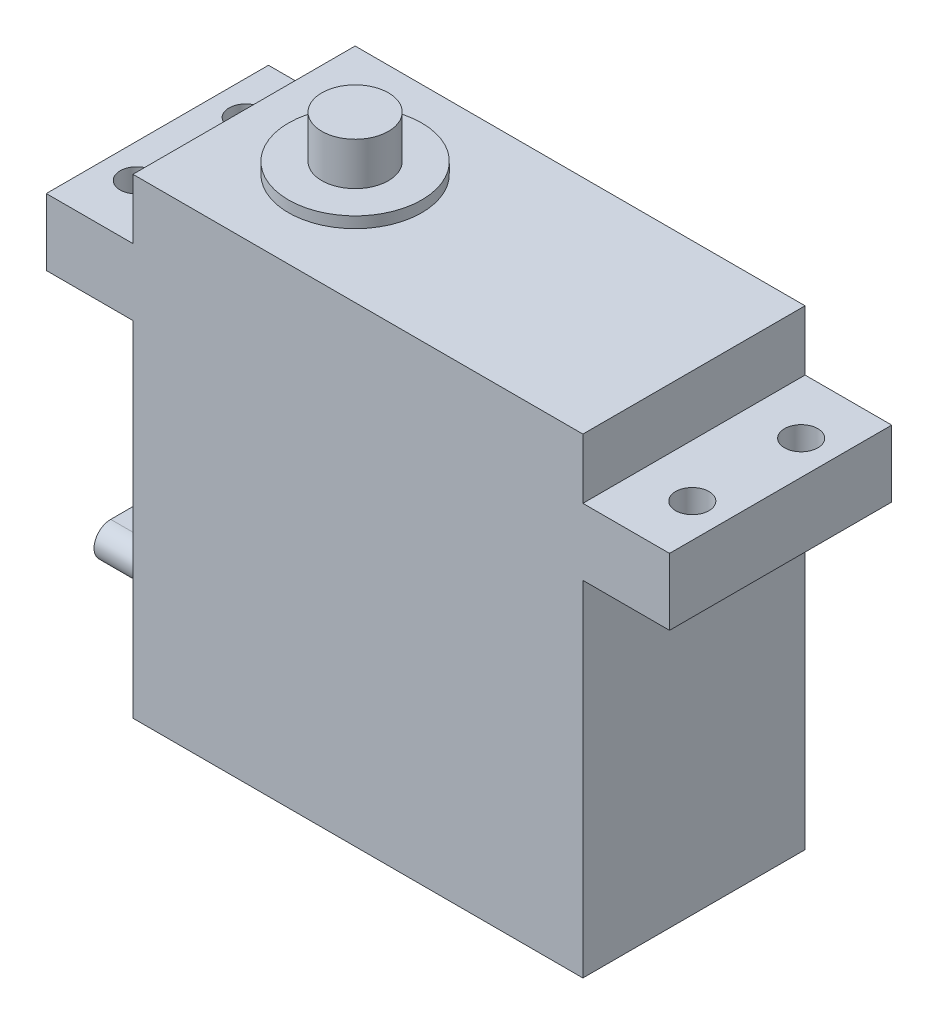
ISO-10303-21;
HEADER;
FILE_DESCRIPTION(('STEP AP214'),'2;1');
FILE_NAME('part.step','',(''),(''),'','','');
FILE_SCHEMA(('AUTOMOTIVE_DESIGN { 1 0 10303 214 1 1 1 1 }'));
ENDSEC;
DATA;
#1=APPLICATION_CONTEXT('core data for automotive mechanical design processes');
#2=APPLICATION_PROTOCOL_DEFINITION('international standard','automotive_design',2000,#1);
#3=PRODUCT_CONTEXT('',#1,'mechanical');
#4=PRODUCT('Part','Part','',(#3));
#5=PRODUCT_RELATED_PRODUCT_CATEGORY('part','',(#4));
#6=PRODUCT_DEFINITION_FORMATION('','',#4);
#7=PRODUCT_DEFINITION_CONTEXT('part definition',#1,'design');
#8=PRODUCT_DEFINITION('design','',#6,#7);
#9=PRODUCT_DEFINITION_SHAPE('','',#8);
#10=(LENGTH_UNIT() NAMED_UNIT(*) SI_UNIT(.MILLI.,.METRE.));
#11=(NAMED_UNIT(*) PLANE_ANGLE_UNIT() SI_UNIT($,.RADIAN.));
#12=(NAMED_UNIT(*) SI_UNIT($,.STERADIAN.) SOLID_ANGLE_UNIT());
#13=UNCERTAINTY_MEASURE_WITH_UNIT(LENGTH_MEASURE(1.E-05),#10,'distance_accuracy_value','');
#14=(GEOMETRIC_REPRESENTATION_CONTEXT(3) GLOBAL_UNCERTAINTY_ASSIGNED_CONTEXT((#13)) GLOBAL_UNIT_ASSIGNED_CONTEXT((#10,
#11,#12)) REPRESENTATION_CONTEXT('',''));
#15=CARTESIAN_POINT('',(0.,0.,0.));
#16=DIRECTION('',(0.,0.,1.));
#17=DIRECTION('',(1.,0.,0.));
#18=AXIS2_PLACEMENT_3D('',#15,#16,#17);
#19=CARTESIAN_POINT('',(10.,47.25,10.));
#20=DIRECTION('',(0.,-1.,0.));
#21=DIRECTION('',(0.,0.,-1.));
#22=AXIS2_PLACEMENT_3D('',#19,#20,#21);
#23=CYLINDRICAL_SURFACE('',#22,3.);
#24=CARTESIAN_POINT('',(10.,47.25,10.));
#25=DIRECTION('',(0.,1.,0.));
#26=DIRECTION('',(0.,0.,1.));
#27=AXIS2_PLACEMENT_3D('',#24,#25,#26);
#28=CIRCLE('',#27,3.);
#29=CARTESIAN_POINT('',(10.,47.25,7.));
#30=VERTEX_POINT('',#29);
#31=EDGE_CURVE('E11',#30,#30,#28,.T.);
#32=CARTESIAN_POINT('',(10.,43.4,10.));
#33=DIRECTION('',(0.,1.,0.));
#34=DIRECTION('',(0.,0.,1.));
#35=AXIS2_PLACEMENT_3D('',#32,#33,#34);
#36=CIRCLE('',#35,3.);
#37=CARTESIAN_POINT('',(10.,43.4,7.));
#38=VERTEX_POINT('',#37);
#39=EDGE_CURVE('E47',#38,#38,#36,.T.);
#40=CARTESIAN_POINT('',(10.,47.25,7.));
#41=CARTESIAN_POINT('',(10.,47.2098958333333,7.));
#42=CARTESIAN_POINT('',(10.,47.1697916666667,7.));
#43=CARTESIAN_POINT('',(10.,47.0895833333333,7.));
#44=CARTESIAN_POINT('',(10.,47.0494791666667,7.));
#45=CARTESIAN_POINT('',(10.,46.9692708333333,7.));
#46=CARTESIAN_POINT('',(10.,46.9291666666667,7.));
#47=CARTESIAN_POINT('',(10.,46.8489583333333,7.));
#48=CARTESIAN_POINT('',(10.,46.8088541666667,7.));
#49=CARTESIAN_POINT('',(10.,46.7286458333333,7.));
#50=CARTESIAN_POINT('',(10.,46.6885416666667,7.));
#51=CARTESIAN_POINT('',(10.,46.6083333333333,7.));
#52=CARTESIAN_POINT('',(10.,46.5682291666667,7.));
#53=CARTESIAN_POINT('',(10.,46.4880208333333,7.));
#54=CARTESIAN_POINT('',(10.,46.4479166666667,7.));
#55=CARTESIAN_POINT('',(10.,46.3677083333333,7.));
#56=CARTESIAN_POINT('',(10.,46.3276041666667,7.));
#57=CARTESIAN_POINT('',(10.,46.2473958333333,7.));
#58=CARTESIAN_POINT('',(10.,46.2072916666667,7.));
#59=CARTESIAN_POINT('',(10.,46.1270833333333,7.));
#60=CARTESIAN_POINT('',(10.,46.0869791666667,7.));
#61=CARTESIAN_POINT('',(10.,46.0067708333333,7.));
#62=CARTESIAN_POINT('',(10.,45.9666666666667,7.));
#63=CARTESIAN_POINT('',(10.,45.8864583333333,7.));
#64=CARTESIAN_POINT('',(10.,45.8463541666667,7.));
#65=CARTESIAN_POINT('',(10.,45.7661458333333,7.));
#66=CARTESIAN_POINT('',(10.,45.7260416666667,7.));
#67=CARTESIAN_POINT('',(10.,45.6458333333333,7.));
#68=CARTESIAN_POINT('',(10.,45.6057291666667,7.));
#69=CARTESIAN_POINT('',(10.,45.5255208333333,7.));
#70=CARTESIAN_POINT('',(10.,45.4854166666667,7.));
#71=CARTESIAN_POINT('',(10.,45.4052083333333,7.));
#72=CARTESIAN_POINT('',(10.,45.3651041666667,7.));
#73=CARTESIAN_POINT('',(10.,45.2848958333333,7.));
#74=CARTESIAN_POINT('',(10.,45.2447916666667,7.));
#75=CARTESIAN_POINT('',(10.,45.1645833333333,7.));
#76=CARTESIAN_POINT('',(10.,45.1244791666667,7.));
#77=CARTESIAN_POINT('',(10.,45.0442708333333,7.));
#78=CARTESIAN_POINT('',(10.,45.0041666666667,7.));
#79=CARTESIAN_POINT('',(10.,44.9239583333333,7.));
#80=CARTESIAN_POINT('',(10.,44.8838541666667,7.));
#81=CARTESIAN_POINT('',(10.,44.8036458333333,7.));
#82=CARTESIAN_POINT('',(10.,44.7635416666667,7.));
#83=CARTESIAN_POINT('',(10.,44.6833333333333,7.));
#84=CARTESIAN_POINT('',(10.,44.6432291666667,7.));
#85=CARTESIAN_POINT('',(10.,44.5630208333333,7.));
#86=CARTESIAN_POINT('',(10.,44.5229166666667,7.));
#87=CARTESIAN_POINT('',(10.,44.4427083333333,7.));
#88=CARTESIAN_POINT('',(10.,44.4026041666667,7.));
#89=CARTESIAN_POINT('',(10.,44.3223958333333,7.));
#90=CARTESIAN_POINT('',(10.,44.2822916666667,7.));
#91=CARTESIAN_POINT('',(10.,44.2020833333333,7.));
#92=CARTESIAN_POINT('',(10.,44.1619791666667,7.));
#93=CARTESIAN_POINT('',(10.,44.0817708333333,7.));
#94=CARTESIAN_POINT('',(10.,44.0416666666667,7.));
#95=CARTESIAN_POINT('',(10.,43.9614583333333,7.));
#96=CARTESIAN_POINT('',(10.,43.9213541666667,7.));
#97=CARTESIAN_POINT('',(10.,43.8411458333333,7.));
#98=CARTESIAN_POINT('',(10.,43.8010416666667,7.));
#99=CARTESIAN_POINT('',(10.,43.7208333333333,7.));
#100=CARTESIAN_POINT('',(10.,43.6807291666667,7.));
#101=CARTESIAN_POINT('',(10.,43.6005208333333,7.));
#102=CARTESIAN_POINT('',(10.,43.5604166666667,7.));
#103=CARTESIAN_POINT('',(10.,43.4802083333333,7.));
#104=CARTESIAN_POINT('',(10.,43.4401041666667,7.));
#105=CARTESIAN_POINT('',(10.,43.4,7.));
#106=B_SPLINE_CURVE_WITH_KNOTS('',3,(#40,#41,#42,#43,#44,#45,#46,#47,#48,#49,#50,#51,#52,#53,
#54,#55,#56,#57,#58,#59,#60,#61,#62,#63,#64,#65,#66,#67,#68,#69,#70,#71,#72,#73,#74,#75,#76,#77,
#78,#79,#80,#81,#82,#83,#84,#85,#86,#87,#88,#89,#90,#91,#92,#93,#94,#95,#96,#97,#98,#99,#100,
#101,#102,#103,#104,#105),.UNSPECIFIED.,.F.,.F.,(4,2,2,2,2,2,2,2,2,2,2,2,2,2,2,2,2,2,2,2,2,2,2,
2,2,2,2,2,2,2,2,2,4),(0.,0.120312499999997,0.240624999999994,0.360937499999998,
0.481249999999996,0.6015625,0.721874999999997,0.842187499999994,0.962499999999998,1.0828125,
1.203125,1.3234375,1.44374999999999,1.5640625,1.68437499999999,1.8046875,1.925,2.04531249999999,
2.165625,2.28593749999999,2.40625,2.5265625,2.64687499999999,2.7671875,2.88749999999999,
3.0078125,3.128125,3.24843749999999,3.36875,3.48906249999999,3.609375,3.7296875,
3.84999999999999),.UNSPECIFIED.);
#107=EDGE_CURVE('BSEAM44',#30,#38,#106,.T.);
#108=ORIENTED_EDGE('',*,*,#31,.F.);
#109=ORIENTED_EDGE('',*,*,#39,.T.);
#110=ORIENTED_EDGE('',*,*,#107,.T.);
#111=ORIENTED_EDGE('',*,*,#107,.F.);
#112=EDGE_LOOP('',(#108,#110,#109,#111));
#113=FACE_BOUND('',#112,.T.);
#114=ADVANCED_FACE('F44',(#113),#23,.T.);
#115=CARTESIAN_POINT('',(10.,47.25,10.));
#116=DIRECTION('',(0.,1.,0.));
#117=DIRECTION('',(0.,0.,1.));
#118=AXIS2_PLACEMENT_3D('',#115,#116,#117);
#119=PLANE('',#118);
#120=ORIENTED_EDGE('',*,*,#31,.T.);
#121=EDGE_LOOP('',(#120));
#122=FACE_BOUND('',#121,.T.);
#123=ADVANCED_FACE('F59',(#122),#119,.T.);
#124=CARTESIAN_POINT('',(10.,43.4,10.));
#125=DIRECTION('',(0.,1.,0.));
#126=DIRECTION('',(0.,0.,1.));
#127=AXIS2_PLACEMENT_3D('',#124,#125,#126);
#128=PLANE('',#127);
#129=ORIENTED_EDGE('',*,*,#39,.F.);
#130=EDGE_LOOP('',(#129));
#131=FACE_BOUND('',#130,.T.);
#132=ADVANCED_FACE('F57',(#131),#128,.F.);
#133=CLOSED_SHELL('',(#114,#123,#132));
#134=MANIFOLD_SOLID_BREP('B2',#133);
#135=CARTESIAN_POINT('',(0.,42.4,20.));
#136=DIRECTION('',(0.,-1.,0.));
#137=DIRECTION('',(0.,0.,-1.));
#138=AXIS2_PLACEMENT_3D('',#135,#136,#137);
#139=PLANE('',#138);
#140=DIRECTION('',(-1.,0.,0.));
#141=VECTOR('',#140,1.);
#142=CARTESIAN_POINT('',(0.,42.4,0.));
#143=LINE('',#142,#141);
#144=CARTESIAN_POINT('',(40.5,42.4,0.));
#145=VERTEX_POINT('',#144);
#146=CARTESIAN_POINT('',(0.,42.4,0.));
#147=VERTEX_POINT('',#146);
#148=EDGE_CURVE('E342',#145,#147,#143,.T.);
#149=ORIENTED_EDGE('',*,*,#148,.T.);
#150=DIRECTION('',(0.,0.,-1.));
#151=VECTOR('',#150,1.);
#152=CARTESIAN_POINT('',(0.,42.4,20.));
#153=LINE('',#152,#151);
#154=CARTESIAN_POINT('',(0.,42.4,20.));
#155=VERTEX_POINT('',#154);
#156=EDGE_CURVE('E362',#155,#147,#153,.T.);
#157=ORIENTED_EDGE('',*,*,#156,.F.);
#158=DIRECTION('',(-1.,0.,0.));
#159=VECTOR('',#158,1.);
#160=CARTESIAN_POINT('',(0.,42.4,20.));
#161=LINE('',#160,#159);
#162=CARTESIAN_POINT('',(40.5,42.4,20.));
#163=VERTEX_POINT('',#162);
#164=EDGE_CURVE('E316',#163,#155,#161,.T.);
#165=ORIENTED_EDGE('',*,*,#164,.F.);
#166=DIRECTION('',(0.,0.,-1.));
#167=VECTOR('',#166,1.);
#168=CARTESIAN_POINT('',(40.5,42.4,20.));
#169=LINE('',#168,#167);
#170=EDGE_CURVE('E365',#163,#145,#169,.T.);
#171=ORIENTED_EDGE('',*,*,#170,.T.);
#172=EDGE_LOOP('',(#149,#157,#165,#171));
#173=FACE_BOUND('',#172,.T.);
#174=CARTESIAN_POINT('',(10.,42.4,10.));
#175=DIRECTION('',(0.,-1.,0.));
#176=DIRECTION('',(0.,0.,-1.));
#177=AXIS2_PLACEMENT_3D('',#174,#175,#176);
#178=CIRCLE('',#177,6.);
#179=CARTESIAN_POINT('',(10.,42.4,4.));
#180=VERTEX_POINT('',#179);
#181=EDGE_CURVE('E42',#180,#180,#178,.F.);
#182=ORIENTED_EDGE('',*,*,#181,.F.);
#183=EDGE_LOOP('',(#182));
#184=FACE_BOUND('',#183,.T.);
#185=ADVANCED_FACE('F84',(#173,#184),#139,.F.);
#186=CARTESIAN_POINT('',(-0.5,4.5,8.50000000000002));
#187=DIRECTION('',(-1.,0.,0.));
#188=DIRECTION('',(0.,0.,1.));
#189=AXIS2_PLACEMENT_3D('',#186,#187,#188);
#190=PLANE('',#189);
#191=CARTESIAN_POINT('',(-0.5,4.5,8.50000000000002));
#192=DIRECTION('',(-1.,0.,0.));
#193=DIRECTION('',(0.,0.,1.));
#194=AXIS2_PLACEMENT_3D('',#191,#192,#193);
#195=CIRCLE('',#194,2.);
#196=CARTESIAN_POINT('',(-0.5,6.5,8.50000000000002));
#197=VERTEX_POINT('',#196);
#198=CARTESIAN_POINT('',(-0.5,2.5,8.50000000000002));
#199=VERTEX_POINT('',#198);
#200=EDGE_CURVE('E253',#197,#199,#195,.T.);
#201=ORIENTED_EDGE('',*,*,#200,.T.);
#202=DIRECTION('',(0.,0.,1.));
#203=VECTOR('',#202,1.);
#204=CARTESIAN_POINT('',(-0.5,2.5,11.5));
#205=LINE('',#204,#203);
#206=CARTESIAN_POINT('',(-0.5,2.5,11.5));
#207=VERTEX_POINT('',#206);
#208=EDGE_CURVE('E256',#199,#207,#205,.T.);
#209=ORIENTED_EDGE('',*,*,#208,.T.);
#210=CARTESIAN_POINT('',(-0.5,4.5,11.5));
#211=DIRECTION('',(-1.,0.,0.));
#212=DIRECTION('',(0.,0.,-1.));
#213=AXIS2_PLACEMENT_3D('',#210,#211,#212);
#214=CIRCLE('',#213,2.);
#215=CARTESIAN_POINT('',(-0.5,6.5,11.5));
#216=VERTEX_POINT('',#215);
#217=EDGE_CURVE('E259',#207,#216,#214,.T.);
#218=ORIENTED_EDGE('',*,*,#217,.T.);
#219=DIRECTION('',(0.,0.,-1.));
#220=VECTOR('',#219,1.);
#221=CARTESIAN_POINT('',(-0.5,6.5,8.50000000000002));
#222=LINE('',#221,#220);
#223=EDGE_CURVE('E261',#216,#197,#222,.T.);
#224=ORIENTED_EDGE('',*,*,#223,.T.);
#225=EDGE_LOOP('',(#201,#209,#218,#224));
#226=FACE_BOUND('',#225,.T.);
#227=DIRECTION('',(0.,0.,1.));
#228=VECTOR('',#227,1.);
#229=CARTESIAN_POINT('',(-0.5,3.,8.50000000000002));
#230=LINE('',#229,#228);
#231=CARTESIAN_POINT('',(-0.5,3.,8.50000000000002));
#232=VERTEX_POINT('',#231);
#233=CARTESIAN_POINT('',(-0.5,3.,11.5));
#234=VERTEX_POINT('',#233);
#235=EDGE_CURVE('E672',#232,#234,#230,.T.);
#236=ORIENTED_EDGE('',*,*,#235,.F.);
#237=CARTESIAN_POINT('',(-0.5,4.5,8.50000000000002));
#238=DIRECTION('',(-1.,0.,0.));
#239=DIRECTION('',(0.,0.,1.));
#240=AXIS2_PLACEMENT_3D('',#237,#238,#239);
#241=CIRCLE('',#240,1.5);
#242=CARTESIAN_POINT('',(-0.5,6.,8.50000000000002));
#243=VERTEX_POINT('',#242);
#244=EDGE_CURVE('E244',#243,#232,#241,.T.);
#245=ORIENTED_EDGE('',*,*,#244,.F.);
#246=DIRECTION('',(0.,0.,-1.));
#247=VECTOR('',#246,1.);
#248=CARTESIAN_POINT('',(-0.5,6.,11.5));
#249=LINE('',#248,#247);
#250=CARTESIAN_POINT('',(-0.5,6.,11.5));
#251=VERTEX_POINT('',#250);
#252=EDGE_CURVE('E240',#251,#243,#249,.T.);
#253=ORIENTED_EDGE('',*,*,#252,.F.);
#254=CARTESIAN_POINT('',(-0.5,4.5,11.5));
#255=DIRECTION('',(-1.,0.,0.));
#256=DIRECTION('',(0.,0.,1.));
#257=AXIS2_PLACEMENT_3D('',#254,#255,#256);
#258=CIRCLE('',#257,1.5);
#259=EDGE_CURVE('E679',#234,#251,#258,.T.);
#260=ORIENTED_EDGE('',*,*,#259,.F.);
#261=EDGE_LOOP('',(#236,#245,#253,#260));
#262=FACE_BOUND('',#261,.T.);
#263=ADVANCED_FACE('F409',(#226,#262),#190,.T.);
#264=CARTESIAN_POINT('',(0.,0.,20.));
#265=DIRECTION('',(1.,0.,0.));
#266=DIRECTION('',(0.,0.,-1.));
#267=AXIS2_PLACEMENT_3D('',#264,#265,#266);
#268=PLANE('',#267);
#269=DIRECTION('',(0.,-1.,0.));
#270=VECTOR('',#269,1.);
#271=CARTESIAN_POINT('',(0.,0.,0.));
#272=LINE('',#271,#270);
#273=CARTESIAN_POINT('',(0.,31.,0.));
#274=VERTEX_POINT('',#273);
#275=CARTESIAN_POINT('',(0.,0.,0.));
#276=VERTEX_POINT('',#275);
#277=EDGE_CURVE('E327',#274,#276,#272,.T.);
#278=ORIENTED_EDGE('',*,*,#277,.T.);
#279=DIRECTION('',(0.,0.,-1.));
#280=VECTOR('',#279,1.);
#281=CARTESIAN_POINT('',(0.,0.,20.));
#282=LINE('',#281,#280);
#283=CARTESIAN_POINT('',(0.,0.,20.));
#284=VERTEX_POINT('',#283);
#285=EDGE_CURVE('E92',#284,#276,#282,.T.);
#286=ORIENTED_EDGE('',*,*,#285,.F.);
#287=DIRECTION('',(0.,-1.,0.));
#288=VECTOR('',#287,1.);
#289=CARTESIAN_POINT('',(0.,0.,20.));
#290=LINE('',#289,#288);
#291=CARTESIAN_POINT('',(0.,31.,20.));
#292=VERTEX_POINT('',#291);
#293=EDGE_CURVE('E300',#292,#284,#290,.T.);
#294=ORIENTED_EDGE('',*,*,#293,.F.);
#295=DIRECTION('',(0.,0.,-1.));
#296=VECTOR('',#295,1.);
#297=CARTESIAN_POINT('',(0.,31.,20.));
#298=LINE('',#297,#296);
#299=EDGE_CURVE('E326',#292,#274,#298,.T.);
#300=ORIENTED_EDGE('',*,*,#299,.T.);
#301=EDGE_LOOP('',(#278,#286,#294,#300));
#302=FACE_BOUND('',#301,.T.);
#303=CARTESIAN_POINT('',(0.,4.5,8.50000000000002));
#304=DIRECTION('',(-1.,0.,0.));
#305=DIRECTION('',(0.,0.,1.));
#306=AXIS2_PLACEMENT_3D('',#303,#304,#305);
#307=CIRCLE('',#306,2.);
#308=CARTESIAN_POINT('',(0.,6.5,8.50000000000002));
#309=VERTEX_POINT('',#308);
#310=CARTESIAN_POINT('',(0.,2.5,8.50000000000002));
#311=VERTEX_POINT('',#310);
#312=EDGE_CURVE('E246',#309,#311,#307,.T.);
#313=ORIENTED_EDGE('',*,*,#312,.F.);
#314=DIRECTION('',(0.,0.,-1.));
#315=VECTOR('',#314,1.);
#316=CARTESIAN_POINT('',(0.,6.5,8.50000000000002));
#317=LINE('',#316,#315);
#318=CARTESIAN_POINT('',(0.,6.5,11.5));
#319=VERTEX_POINT('',#318);
#320=EDGE_CURVE('E257',#319,#309,#317,.T.);
#321=ORIENTED_EDGE('',*,*,#320,.F.);
#322=CARTESIAN_POINT('',(0.,4.5,11.5));
#323=DIRECTION('',(-1.,0.,0.));
#324=DIRECTION('',(0.,0.,-1.));
#325=AXIS2_PLACEMENT_3D('',#322,#323,#324);
#326=CIRCLE('',#325,2.);
#327=CARTESIAN_POINT('',(0.,2.5,11.5));
#328=VERTEX_POINT('',#327);
#329=EDGE_CURVE('E265',#328,#319,#326,.T.);
#330=ORIENTED_EDGE('',*,*,#329,.F.);
#331=DIRECTION('',(0.,0.,1.));
#332=VECTOR('',#331,1.);
#333=CARTESIAN_POINT('',(0.,2.5,11.5));
#334=LINE('',#333,#332);
#335=EDGE_CURVE('E107',#311,#328,#334,.T.);
#336=ORIENTED_EDGE('',*,*,#335,.F.);
#337=EDGE_LOOP('',(#313,#321,#330,#336));
#338=FACE_BOUND('',#337,.T.);
#339=ADVANCED_FACE('F86',(#302,#338),#268,.F.);
#340=CARTESIAN_POINT('',(0.,0.,20.));
#341=DIRECTION('',(0.,1.,0.));
#342=DIRECTION('',(0.,0.,1.));
#343=AXIS2_PLACEMENT_3D('',#340,#341,#342);
#344=PLANE('',#343);
#345=DIRECTION('',(1.,0.,0.));
#346=VECTOR('',#345,1.);
#347=CARTESIAN_POINT('',(0.,0.,0.));
#348=LINE('',#347,#346);
#349=CARTESIAN_POINT('',(40.5,0.,0.));
#350=VERTEX_POINT('',#349);
#351=EDGE_CURVE('E330',#276,#350,#348,.T.);
#352=ORIENTED_EDGE('',*,*,#351,.T.);
#353=DIRECTION('',(0.,0.,-1.));
#354=VECTOR('',#353,1.);
#355=CARTESIAN_POINT('',(40.5,0.,20.));
#356=LINE('',#355,#354);
#357=CARTESIAN_POINT('',(40.5,0.,20.));
#358=VERTEX_POINT('',#357);
#359=EDGE_CURVE('E380',#358,#350,#356,.T.);
#360=ORIENTED_EDGE('',*,*,#359,.F.);
#361=DIRECTION('',(1.,0.,0.));
#362=VECTOR('',#361,1.);
#363=CARTESIAN_POINT('',(0.,0.,20.));
#364=LINE('',#363,#362);
#365=EDGE_CURVE('E303',#284,#358,#364,.T.);
#366=ORIENTED_EDGE('',*,*,#365,.F.);
#367=ORIENTED_EDGE('',*,*,#285,.T.);
#368=EDGE_LOOP('',(#352,#360,#366,#367));
#369=FACE_BOUND('',#368,.T.);
#370=ADVANCED_FACE('F440',(#369),#344,.F.);
#371=CARTESIAN_POINT('',(40.5,0.,20.));
#372=DIRECTION('',(-1.,0.,0.));
#373=DIRECTION('',(0.,0.,1.));
#374=AXIS2_PLACEMENT_3D('',#371,#372,#373);
#375=PLANE('',#374);
#376=DIRECTION('',(0.,1.,0.));
#377=VECTOR('',#376,1.);
#378=CARTESIAN_POINT('',(40.5,0.,0.));
#379=LINE('',#378,#377);
#380=CARTESIAN_POINT('',(40.5,31.,0.));
#381=VERTEX_POINT('',#380);
#382=EDGE_CURVE('E332',#350,#381,#379,.T.);
#383=ORIENTED_EDGE('',*,*,#382,.T.);
#384=DIRECTION('',(0.,0.,-1.));
#385=VECTOR('',#384,1.);
#386=CARTESIAN_POINT('',(40.5,31.,20.));
#387=LINE('',#386,#385);
#388=CARTESIAN_POINT('',(40.5,31.,20.));
#389=VERTEX_POINT('',#388);
#390=EDGE_CURVE('E377',#389,#381,#387,.T.);
#391=ORIENTED_EDGE('',*,*,#390,.F.);
#392=DIRECTION('',(0.,1.,0.));
#393=VECTOR('',#392,1.);
#394=CARTESIAN_POINT('',(40.5,0.,20.));
#395=LINE('',#394,#393);
#396=EDGE_CURVE('E306',#358,#389,#395,.T.);
#397=ORIENTED_EDGE('',*,*,#396,.F.);
#398=ORIENTED_EDGE('',*,*,#359,.T.);
#399=EDGE_LOOP('',(#383,#391,#397,#398));
#400=FACE_BOUND('',#399,.T.);
#401=ADVANCED_FACE('F437',(#400),#375,.F.);
#402=CARTESIAN_POINT('',(40.5,31.,20.));
#403=DIRECTION('',(0.,1.,0.));
#404=DIRECTION('',(0.,0.,1.));
#405=AXIS2_PLACEMENT_3D('',#402,#403,#404);
#406=PLANE('',#405);
#407=CARTESIAN_POINT('',(45.25,31.,5.1));
#408=DIRECTION('',(0.,1.,0.));
#409=DIRECTION('',(0.,0.,1.));
#410=AXIS2_PLACEMENT_3D('',#407,#408,#409);
#411=CIRCLE('',#410,1.5);
#412=CARTESIAN_POINT('',(45.25,31.,6.6));
#413=VERTEX_POINT('',#412);
#414=EDGE_CURVE('E283',#413,#413,#411,.T.);
#415=ORIENTED_EDGE('',*,*,#414,.T.);
#416=EDGE_LOOP('',(#415));
#417=FACE_BOUND('',#416,.T.);
#418=CARTESIAN_POINT('',(45.25,31.,14.9));
#419=DIRECTION('',(0.,1.,0.));
#420=DIRECTION('',(0.,0.,1.));
#421=AXIS2_PLACEMENT_3D('',#418,#419,#420);
#422=CIRCLE('',#421,1.5);
#423=CARTESIAN_POINT('',(45.25,31.,16.4));
#424=VERTEX_POINT('',#423);
#425=EDGE_CURVE('E289',#424,#424,#422,.T.);
#426=ORIENTED_EDGE('',*,*,#425,.T.);
#427=EDGE_LOOP('',(#426));
#428=FACE_BOUND('',#427,.T.);
#429=DIRECTION('',(1.,0.,0.));
#430=VECTOR('',#429,1.);
#431=CARTESIAN_POINT('',(40.5,31.,0.));
#432=LINE('',#431,#430);
#433=CARTESIAN_POINT('',(48.3,31.,0.));
#434=VERTEX_POINT('',#433);
#435=EDGE_CURVE('E334',#381,#434,#432,.T.);
#436=ORIENTED_EDGE('',*,*,#435,.T.);
#437=DIRECTION('',(0.,0.,-1.));
#438=VECTOR('',#437,1.);
#439=CARTESIAN_POINT('',(48.3,31.,20.));
#440=LINE('',#439,#438);
#441=CARTESIAN_POINT('',(48.3,31.,20.));
#442=VERTEX_POINT('',#441);
#443=EDGE_CURVE('E374',#442,#434,#440,.T.);
#444=ORIENTED_EDGE('',*,*,#443,.F.);
#445=DIRECTION('',(1.,0.,0.));
#446=VECTOR('',#445,1.);
#447=CARTESIAN_POINT('',(40.5,31.,20.));
#448=LINE('',#447,#446);
#449=EDGE_CURVE('E308',#389,#442,#448,.T.);
#450=ORIENTED_EDGE('',*,*,#449,.F.);
#451=ORIENTED_EDGE('',*,*,#390,.T.);
#452=EDGE_LOOP('',(#436,#444,#450,#451));
#453=FACE_BOUND('',#452,.T.);
#454=ADVANCED_FACE('F433',(#417,#428,#453),#406,.F.);
#455=CARTESIAN_POINT('',(48.3,31.,20.));
#456=DIRECTION('',(-1.,0.,0.));
#457=DIRECTION('',(0.,-1.,0.));
#458=AXIS2_PLACEMENT_3D('',#455,#456,#457);
#459=PLANE('',#458);
#460=DIRECTION('',(0.,1.,0.));
#461=VECTOR('',#460,1.);
#462=CARTESIAN_POINT('',(48.3,31.,0.));
#463=LINE('',#462,#461);
#464=CARTESIAN_POINT('',(48.3,37.,0.));
#465=VERTEX_POINT('',#464);
#466=EDGE_CURVE('E336',#434,#465,#463,.T.);
#467=ORIENTED_EDGE('',*,*,#466,.T.);
#468=DIRECTION('',(0.,0.,-1.));
#469=VECTOR('',#468,1.);
#470=CARTESIAN_POINT('',(48.3,37.,20.));
#471=LINE('',#470,#469);
#472=CARTESIAN_POINT('',(48.3,37.,20.));
#473=VERTEX_POINT('',#472);
#474=EDGE_CURVE('E371',#473,#465,#471,.T.);
#475=ORIENTED_EDGE('',*,*,#474,.F.);
#476=DIRECTION('',(0.,1.,0.));
#477=VECTOR('',#476,1.);
#478=CARTESIAN_POINT('',(48.3,31.,20.));
#479=LINE('',#478,#477);
#480=EDGE_CURVE('E310',#442,#473,#479,.T.);
#481=ORIENTED_EDGE('',*,*,#480,.F.);
#482=ORIENTED_EDGE('',*,*,#443,.T.);
#483=EDGE_LOOP('',(#467,#475,#481,#482));
#484=FACE_BOUND('',#483,.T.);
#485=ADVANCED_FACE('F429',(#484),#459,.F.);
#486=CARTESIAN_POINT('',(48.3,37.,20.));
#487=DIRECTION('',(0.,-1.,0.));
#488=DIRECTION('',(1.,0.,0.));
#489=AXIS2_PLACEMENT_3D('',#486,#487,#488);
#490=PLANE('',#489);
#491=CARTESIAN_POINT('',(45.25,37.,5.1));
#492=DIRECTION('',(0.,1.,0.));
#493=DIRECTION('',(0.,0.,1.));
#494=AXIS2_PLACEMENT_3D('',#491,#492,#493);
#495=CIRCLE('',#494,1.5);
#496=CARTESIAN_POINT('',(45.25,37.,6.6));
#497=VERTEX_POINT('',#496);
#498=EDGE_CURVE('E280',#497,#497,#495,.T.);
#499=ORIENTED_EDGE('',*,*,#498,.F.);
#500=EDGE_LOOP('',(#499));
#501=FACE_BOUND('',#500,.T.);
#502=CARTESIAN_POINT('',(45.25,37.,14.9));
#503=DIRECTION('',(0.,1.,0.));
#504=DIRECTION('',(0.,0.,1.));
#505=AXIS2_PLACEMENT_3D('',#502,#503,#504);
#506=CIRCLE('',#505,1.5);
#507=CARTESIAN_POINT('',(45.25,37.,16.4));
#508=VERTEX_POINT('',#507);
#509=EDGE_CURVE('E286',#508,#508,#506,.T.);
#510=ORIENTED_EDGE('',*,*,#509,.F.);
#511=EDGE_LOOP('',(#510));
#512=FACE_BOUND('',#511,.T.);
#513=DIRECTION('',(-1.,0.,0.));
#514=VECTOR('',#513,1.);
#515=CARTESIAN_POINT('',(48.3,37.,0.));
#516=LINE('',#515,#514);
#517=CARTESIAN_POINT('',(40.5,37.,0.));
#518=VERTEX_POINT('',#517);
#519=EDGE_CURVE('E338',#465,#518,#516,.T.);
#520=ORIENTED_EDGE('',*,*,#519,.T.);
#521=DIRECTION('',(0.,0.,-1.));
#522=VECTOR('',#521,1.);
#523=CARTESIAN_POINT('',(40.5,37.,20.));
#524=LINE('',#523,#522);
#525=CARTESIAN_POINT('',(40.5,37.,20.));
#526=VERTEX_POINT('',#525);
#527=EDGE_CURVE('E368',#526,#518,#524,.T.);
#528=ORIENTED_EDGE('',*,*,#527,.F.);
#529=DIRECTION('',(-1.,0.,0.));
#530=VECTOR('',#529,1.);
#531=CARTESIAN_POINT('',(48.3,37.,20.));
#532=LINE('',#531,#530);
#533=EDGE_CURVE('E312',#473,#526,#532,.T.);
#534=ORIENTED_EDGE('',*,*,#533,.F.);
#535=ORIENTED_EDGE('',*,*,#474,.T.);
#536=EDGE_LOOP('',(#520,#528,#534,#535));
#537=FACE_BOUND('',#536,.T.);
#538=ADVANCED_FACE('F425',(#501,#512,#537),#490,.F.);
#539=CARTESIAN_POINT('',(40.5,37.,20.));
#540=DIRECTION('',(-1.,0.,0.));
#541=DIRECTION('',(0.,0.,1.));
#542=AXIS2_PLACEMENT_3D('',#539,#540,#541);
#543=PLANE('',#542);
#544=DIRECTION('',(0.,1.,0.));
#545=VECTOR('',#544,1.);
#546=CARTESIAN_POINT('',(40.5,37.,0.));
#547=LINE('',#546,#545);
#548=EDGE_CURVE('E340',#518,#145,#547,.T.);
#549=ORIENTED_EDGE('',*,*,#548,.T.);
#550=ORIENTED_EDGE('',*,*,#170,.F.);
#551=DIRECTION('',(0.,1.,0.));
#552=VECTOR('',#551,1.);
#553=CARTESIAN_POINT('',(40.5,37.,20.));
#554=LINE('',#553,#552);
#555=EDGE_CURVE('E314',#526,#163,#554,.T.);
#556=ORIENTED_EDGE('',*,*,#555,.F.);
#557=ORIENTED_EDGE('',*,*,#527,.T.);
#558=EDGE_LOOP('',(#549,#550,#556,#557));
#559=FACE_BOUND('',#558,.T.);
#560=ADVANCED_FACE('F422',(#559),#543,.F.);
#561=CARTESIAN_POINT('',(0.,37.,20.));
#562=DIRECTION('',(1.,0.,0.));
#563=DIRECTION('',(0.,1.,0.));
#564=AXIS2_PLACEMENT_3D('',#561,#562,#563);
#565=PLANE('',#564);
#566=DIRECTION('',(0.,-1.,0.));
#567=VECTOR('',#566,1.);
#568=CARTESIAN_POINT('',(0.,37.,0.));
#569=LINE('',#568,#567);
#570=CARTESIAN_POINT('',(0.,37.,0.));
#571=VERTEX_POINT('',#570);
#572=EDGE_CURVE('E344',#147,#571,#569,.T.);
#573=ORIENTED_EDGE('',*,*,#572,.T.);
#574=DIRECTION('',(0.,0.,-1.));
#575=VECTOR('',#574,1.);
#576=CARTESIAN_POINT('',(0.,37.,20.));
#577=LINE('',#576,#575);
#578=CARTESIAN_POINT('',(0.,37.,20.));
#579=VERTEX_POINT('',#578);
#580=EDGE_CURVE('E359',#579,#571,#577,.T.);
#581=ORIENTED_EDGE('',*,*,#580,.F.);
#582=DIRECTION('',(0.,-1.,0.));
#583=VECTOR('',#582,1.);
#584=CARTESIAN_POINT('',(0.,37.,20.));
#585=LINE('',#584,#583);
#586=EDGE_CURVE('E318',#155,#579,#585,.T.);
#587=ORIENTED_EDGE('',*,*,#586,.F.);
#588=ORIENTED_EDGE('',*,*,#156,.T.);
#589=EDGE_LOOP('',(#573,#581,#587,#588));
#590=FACE_BOUND('',#589,.T.);
#591=ADVANCED_FACE('F420',(#590),#565,.F.);
#592=CARTESIAN_POINT('',(0.,37.,20.));
#593=DIRECTION('',(0.,-1.,0.));
#594=DIRECTION('',(0.,0.,-1.));
#595=AXIS2_PLACEMENT_3D('',#592,#593,#594);
#596=PLANE('',#595);
#597=CARTESIAN_POINT('',(-4.75,37.,14.9));
#598=DIRECTION('',(0.,1.,0.));
#599=DIRECTION('',(0.,0.,1.));
#600=AXIS2_PLACEMENT_3D('',#597,#598,#599);
#601=CIRCLE('',#600,1.5);
#602=CARTESIAN_POINT('',(-4.75,37.,16.4));
#603=VERTEX_POINT('',#602);
#604=EDGE_CURVE('E292',#603,#603,#601,.T.);
#605=ORIENTED_EDGE('',*,*,#604,.F.);
#606=EDGE_LOOP('',(#605));
#607=FACE_BOUND('',#606,.T.);
#608=CARTESIAN_POINT('',(-4.75,37.,5.1));
#609=DIRECTION('',(0.,1.,0.));
#610=DIRECTION('',(0.,0.,1.));
#611=AXIS2_PLACEMENT_3D('',#608,#609,#610);
#612=CIRCLE('',#611,1.5);
#613=CARTESIAN_POINT('',(-4.75,37.,6.6));
#614=VERTEX_POINT('',#613);
#615=EDGE_CURVE('E296',#614,#614,#612,.T.);
#616=ORIENTED_EDGE('',*,*,#615,.F.);
#617=EDGE_LOOP('',(#616));
#618=FACE_BOUND('',#617,.T.);
#619=DIRECTION('',(-1.,0.,0.));
#620=VECTOR('',#619,1.);
#621=CARTESIAN_POINT('',(0.,37.,0.));
#622=LINE('',#621,#620);
#623=CARTESIAN_POINT('',(-7.8,37.,0.));
#624=VERTEX_POINT('',#623);
#625=EDGE_CURVE('E346',#571,#624,#622,.T.);
#626=ORIENTED_EDGE('',*,*,#625,.T.);
#627=DIRECTION('',(0.,0.,-1.));
#628=VECTOR('',#627,1.);
#629=CARTESIAN_POINT('',(-7.8,37.,20.));
#630=LINE('',#629,#628);
#631=CARTESIAN_POINT('',(-7.8,37.,20.));
#632=VERTEX_POINT('',#631);
#633=EDGE_CURVE('E356',#632,#624,#630,.T.);
#634=ORIENTED_EDGE('',*,*,#633,.F.);
#635=DIRECTION('',(-1.,0.,0.));
#636=VECTOR('',#635,1.);
#637=CARTESIAN_POINT('',(0.,37.,20.));
#638=LINE('',#637,#636);
#639=EDGE_CURVE('E320',#579,#632,#638,.T.);
#640=ORIENTED_EDGE('',*,*,#639,.F.);
#641=ORIENTED_EDGE('',*,*,#580,.T.);
#642=EDGE_LOOP('',(#626,#634,#640,#641));
#643=FACE_BOUND('',#642,.T.);
#644=ADVANCED_FACE('F481',(#607,#618,#643),#596,.F.);
#645=CARTESIAN_POINT('',(-7.8,31.,20.));
#646=DIRECTION('',(1.,0.,0.));
#647=DIRECTION('',(0.,1.,0.));
#648=AXIS2_PLACEMENT_3D('',#645,#646,#647);
#649=PLANE('',#648);
#650=DIRECTION('',(0.,-1.,0.));
#651=VECTOR('',#650,1.);
#652=CARTESIAN_POINT('',(-7.8,31.,0.));
#653=LINE('',#652,#651);
#654=CARTESIAN_POINT('',(-7.8,31.,0.));
#655=VERTEX_POINT('',#654);
#656=EDGE_CURVE('E348',#624,#655,#653,.T.);
#657=ORIENTED_EDGE('',*,*,#656,.T.);
#658=DIRECTION('',(0.,0.,-1.));
#659=VECTOR('',#658,1.);
#660=CARTESIAN_POINT('',(-7.8,31.,20.));
#661=LINE('',#660,#659);
#662=CARTESIAN_POINT('',(-7.8,31.,20.));
#663=VERTEX_POINT('',#662);
#664=EDGE_CURVE('E353',#663,#655,#661,.T.);
#665=ORIENTED_EDGE('',*,*,#664,.F.);
#666=DIRECTION('',(0.,-1.,0.));
#667=VECTOR('',#666,1.);
#668=CARTESIAN_POINT('',(-7.8,31.,20.));
#669=LINE('',#668,#667);
#670=EDGE_CURVE('E322',#632,#663,#669,.T.);
#671=ORIENTED_EDGE('',*,*,#670,.F.);
#672=ORIENTED_EDGE('',*,*,#633,.T.);
#673=EDGE_LOOP('',(#657,#665,#671,#672));
#674=FACE_BOUND('',#673,.T.);
#675=ADVANCED_FACE('F477',(#674),#649,.F.);
#676=CARTESIAN_POINT('',(-7.8,31.,20.));
#677=DIRECTION('',(0.,1.,0.));
#678=DIRECTION('',(0.,0.,1.));
#679=AXIS2_PLACEMENT_3D('',#676,#677,#678);
#680=PLANE('',#679);
#681=CARTESIAN_POINT('',(-4.75,31.,14.9));
#682=DIRECTION('',(0.,1.,0.));
#683=DIRECTION('',(0.,0.,1.));
#684=AXIS2_PLACEMENT_3D('',#681,#682,#683);
#685=CIRCLE('',#684,1.5);
#686=CARTESIAN_POINT('',(-4.75,31.,16.4));
#687=VERTEX_POINT('',#686);
#688=EDGE_CURVE('E295',#687,#687,#685,.T.);
#689=ORIENTED_EDGE('',*,*,#688,.T.);
#690=EDGE_LOOP('',(#689));
#691=FACE_BOUND('',#690,.T.);
#692=CARTESIAN_POINT('',(-4.75,31.,5.1));
#693=DIRECTION('',(0.,1.,0.));
#694=DIRECTION('',(0.,0.,1.));
#695=AXIS2_PLACEMENT_3D('',#692,#693,#694);
#696=CIRCLE('',#695,1.5);
#697=CARTESIAN_POINT('',(-4.75,31.,6.6));
#698=VERTEX_POINT('',#697);
#699=EDGE_CURVE('E299',#698,#698,#696,.T.);
#700=ORIENTED_EDGE('',*,*,#699,.T.);
#701=EDGE_LOOP('',(#700));
#702=FACE_BOUND('',#701,.T.);
#703=DIRECTION('',(1.,0.,0.));
#704=VECTOR('',#703,1.);
#705=CARTESIAN_POINT('',(-7.8,31.,0.));
#706=LINE('',#705,#704);
#707=EDGE_CURVE('E304',#655,#274,#706,.T.);
#708=ORIENTED_EDGE('',*,*,#707,.T.);
#709=ORIENTED_EDGE('',*,*,#299,.F.);
#710=DIRECTION('',(1.,0.,0.));
#711=VECTOR('',#710,1.);
#712=CARTESIAN_POINT('',(-7.8,31.,20.));
#713=LINE('',#712,#711);
#714=EDGE_CURVE('E324',#663,#292,#713,.T.);
#715=ORIENTED_EDGE('',*,*,#714,.F.);
#716=ORIENTED_EDGE('',*,*,#664,.T.);
#717=EDGE_LOOP('',(#708,#709,#715,#716));
#718=FACE_BOUND('',#717,.T.);
#719=ADVANCED_FACE('F389',(#691,#702,#718),#680,.F.);
#720=CARTESIAN_POINT('',(0.,31.,20.));
#721=DIRECTION('',(0.,0.,-1.));
#722=DIRECTION('',(-1.,0.,0.));
#723=AXIS2_PLACEMENT_3D('',#720,#721,#722);
#724=PLANE('',#723);
#725=ORIENTED_EDGE('',*,*,#293,.T.);
#726=ORIENTED_EDGE('',*,*,#365,.T.);
#727=ORIENTED_EDGE('',*,*,#396,.T.);
#728=ORIENTED_EDGE('',*,*,#449,.T.);
#729=ORIENTED_EDGE('',*,*,#480,.T.);
#730=ORIENTED_EDGE('',*,*,#533,.T.);
#731=ORIENTED_EDGE('',*,*,#555,.T.);
#732=ORIENTED_EDGE('',*,*,#164,.T.);
#733=ORIENTED_EDGE('',*,*,#586,.T.);
#734=ORIENTED_EDGE('',*,*,#639,.T.);
#735=ORIENTED_EDGE('',*,*,#670,.T.);
#736=ORIENTED_EDGE('',*,*,#714,.T.);
#737=EDGE_LOOP('',(#725,#726,#727,#728,#729,#730,#731,#732,#733,#734,#735,#736));
#738=FACE_BOUND('',#737,.T.);
#739=ADVANCED_FACE('F465',(#738),#724,.F.);
#740=CARTESIAN_POINT('',(0.,31.,0.));
#741=DIRECTION('',(0.,0.,-1.));
#742=DIRECTION('',(-1.,0.,0.));
#743=AXIS2_PLACEMENT_3D('',#740,#741,#742);
#744=PLANE('',#743);
#745=ORIENTED_EDGE('',*,*,#277,.F.);
#746=ORIENTED_EDGE('',*,*,#707,.F.);
#747=ORIENTED_EDGE('',*,*,#656,.F.);
#748=ORIENTED_EDGE('',*,*,#625,.F.);
#749=ORIENTED_EDGE('',*,*,#572,.F.);
#750=ORIENTED_EDGE('',*,*,#148,.F.);
#751=ORIENTED_EDGE('',*,*,#548,.F.);
#752=ORIENTED_EDGE('',*,*,#519,.F.);
#753=ORIENTED_EDGE('',*,*,#466,.F.);
#754=ORIENTED_EDGE('',*,*,#435,.F.);
#755=ORIENTED_EDGE('',*,*,#382,.F.);
#756=ORIENTED_EDGE('',*,*,#351,.F.);
#757=EDGE_LOOP('',(#745,#746,#747,#748,#749,#750,#751,#752,#753,#754,#755,#756));
#758=FACE_BOUND('',#757,.T.);
#759=ADVANCED_FACE('F405',(#758),#744,.T.);
#760=CARTESIAN_POINT('',(-4.75,0.,5.1));
#761=DIRECTION('',(0.,1.,0.));
#762=DIRECTION('',(0.,0.,1.));
#763=AXIS2_PLACEMENT_3D('',#760,#761,#762);
#764=CYLINDRICAL_SURFACE('',#763,1.5);
#765=ORIENTED_EDGE('',*,*,#615,.T.);
#766=EDGE_LOOP('',(#765));
#767=FACE_BOUND('',#766,.T.);
#768=ORIENTED_EDGE('',*,*,#699,.F.);
#769=EDGE_LOOP('',(#768));
#770=FACE_BOUND('',#769,.T.);
#771=ADVANCED_FACE('F395',(#767,#770),#764,.F.);
#772=CARTESIAN_POINT('',(-4.75,0.,14.9));
#773=DIRECTION('',(0.,1.,0.));
#774=DIRECTION('',(0.,0.,1.));
#775=AXIS2_PLACEMENT_3D('',#772,#773,#774);
#776=CYLINDRICAL_SURFACE('',#775,1.5);
#777=ORIENTED_EDGE('',*,*,#604,.T.);
#778=EDGE_LOOP('',(#777));
#779=FACE_BOUND('',#778,.T.);
#780=ORIENTED_EDGE('',*,*,#688,.F.);
#781=EDGE_LOOP('',(#780));
#782=FACE_BOUND('',#781,.T.);
#783=ADVANCED_FACE('F392',(#779,#782),#776,.F.);
#784=CARTESIAN_POINT('',(45.25,0.,14.9));
#785=DIRECTION('',(0.,1.,0.));
#786=DIRECTION('',(0.,0.,1.));
#787=AXIS2_PLACEMENT_3D('',#784,#785,#786);
#788=CYLINDRICAL_SURFACE('',#787,1.5);
#789=ORIENTED_EDGE('',*,*,#509,.T.);
#790=EDGE_LOOP('',(#789));
#791=FACE_BOUND('',#790,.T.);
#792=ORIENTED_EDGE('',*,*,#425,.F.);
#793=EDGE_LOOP('',(#792));
#794=FACE_BOUND('',#793,.T.);
#795=ADVANCED_FACE('F394',(#791,#794),#788,.F.);
#796=CARTESIAN_POINT('',(45.25,0.,5.1));
#797=DIRECTION('',(0.,1.,0.));
#798=DIRECTION('',(0.,0.,1.));
#799=AXIS2_PLACEMENT_3D('',#796,#797,#798);
#800=CYLINDRICAL_SURFACE('',#799,1.5);
#801=ORIENTED_EDGE('',*,*,#498,.T.);
#802=EDGE_LOOP('',(#801));
#803=FACE_BOUND('',#802,.T.);
#804=ORIENTED_EDGE('',*,*,#414,.F.);
#805=EDGE_LOOP('',(#804));
#806=FACE_BOUND('',#805,.T.);
#807=ADVANCED_FACE('F402',(#803,#806),#800,.F.);
#808=CARTESIAN_POINT('',(-0.5,4.5,8.50000000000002));
#809=DIRECTION('',(1.,0.,0.));
#810=DIRECTION('',(0.,0.,-1.));
#811=AXIS2_PLACEMENT_3D('',#808,#809,#810);
#812=CYLINDRICAL_SURFACE('',#811,2.);
#813=ORIENTED_EDGE('',*,*,#312,.T.);
#814=DIRECTION('',(1.,0.,0.));
#815=VECTOR('',#814,1.);
#816=CARTESIAN_POINT('',(-0.5,2.5,8.50000000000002));
#817=LINE('',#816,#815);
#818=EDGE_CURVE('E278',#199,#311,#817,.T.);
#819=ORIENTED_EDGE('',*,*,#818,.F.);
#820=ORIENTED_EDGE('',*,*,#200,.F.);
#821=DIRECTION('',(1.,0.,0.));
#822=VECTOR('',#821,1.);
#823=CARTESIAN_POINT('',(-0.5,6.5,8.50000000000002));
#824=LINE('',#823,#822);
#825=EDGE_CURVE('E262',#197,#309,#824,.T.);
#826=ORIENTED_EDGE('',*,*,#825,.T.);
#827=EDGE_LOOP('',(#813,#819,#820,#826));
#828=FACE_BOUND('',#827,.T.);
#829=ADVANCED_FACE('F545',(#828),#812,.T.);
#830=CARTESIAN_POINT('',(-0.5,2.5,11.5));
#831=DIRECTION('',(0.,1.,0.));
#832=DIRECTION('',(0.,0.,1.));
#833=AXIS2_PLACEMENT_3D('',#830,#831,#832);
#834=PLANE('',#833);
#835=ORIENTED_EDGE('',*,*,#335,.T.);
#836=DIRECTION('',(1.,0.,0.));
#837=VECTOR('',#836,1.);
#838=CARTESIAN_POINT('',(-0.5,2.5,11.5));
#839=LINE('',#838,#837);
#840=EDGE_CURVE('E275',#207,#328,#839,.T.);
#841=ORIENTED_EDGE('',*,*,#840,.F.);
#842=ORIENTED_EDGE('',*,*,#208,.F.);
#843=ORIENTED_EDGE('',*,*,#818,.T.);
#844=EDGE_LOOP('',(#835,#841,#842,#843));
#845=FACE_BOUND('',#844,.T.);
#846=ADVANCED_FACE('F561',(#845),#834,.F.);
#847=CARTESIAN_POINT('',(-0.5,4.5,11.5));
#848=DIRECTION('',(1.,0.,0.));
#849=DIRECTION('',(0.,0.,-1.));
#850=AXIS2_PLACEMENT_3D('',#847,#848,#849);
#851=CYLINDRICAL_SURFACE('',#850,2.);
#852=ORIENTED_EDGE('',*,*,#329,.T.);
#853=DIRECTION('',(1.,0.,0.));
#854=VECTOR('',#853,1.);
#855=CARTESIAN_POINT('',(-0.5,6.5,11.5));
#856=LINE('',#855,#854);
#857=EDGE_CURVE('E272',#216,#319,#856,.T.);
#858=ORIENTED_EDGE('',*,*,#857,.F.);
#859=ORIENTED_EDGE('',*,*,#217,.F.);
#860=ORIENTED_EDGE('',*,*,#840,.T.);
#861=EDGE_LOOP('',(#852,#858,#859,#860));
#862=FACE_BOUND('',#861,.T.);
#863=ADVANCED_FACE('F571',(#862),#851,.T.);
#864=CARTESIAN_POINT('',(-0.5,6.5,8.50000000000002));
#865=DIRECTION('',(0.,-1.,0.));
#866=DIRECTION('',(0.,0.,-1.));
#867=AXIS2_PLACEMENT_3D('',#864,#865,#866);
#868=PLANE('',#867);
#869=ORIENTED_EDGE('',*,*,#320,.T.);
#870=ORIENTED_EDGE('',*,*,#825,.F.);
#871=ORIENTED_EDGE('',*,*,#223,.F.);
#872=ORIENTED_EDGE('',*,*,#857,.T.);
#873=EDGE_LOOP('',(#869,#870,#871,#872));
#874=FACE_BOUND('',#873,.T.);
#875=ADVANCED_FACE('F581',(#874),#868,.F.);
#876=CARTESIAN_POINT('',(-10.5,4.5,8.50000000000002));
#877=DIRECTION('',(1.,0.,0.));
#878=DIRECTION('',(0.,0.,-1.));
#879=AXIS2_PLACEMENT_3D('',#876,#877,#878);
#880=CYLINDRICAL_SURFACE('',#879,1.5);
#881=ORIENTED_EDGE('',*,*,#244,.T.);
#882=DIRECTION('',(1.,0.,0.));
#883=VECTOR('',#882,1.);
#884=CARTESIAN_POINT('',(-10.5,3.,8.50000000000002));
#885=LINE('',#884,#883);
#886=CARTESIAN_POINT('',(-10.5,3.,8.50000000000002));
#887=VERTEX_POINT('',#886);
#888=EDGE_CURVE('E225',#887,#232,#885,.T.);
#889=ORIENTED_EDGE('',*,*,#888,.F.);
#890=CARTESIAN_POINT('',(-10.5,4.5,8.50000000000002));
#891=DIRECTION('',(-1.,0.,0.));
#892=DIRECTION('',(0.,0.,1.));
#893=AXIS2_PLACEMENT_3D('',#890,#891,#892);
#894=CIRCLE('',#893,1.5);
#895=CARTESIAN_POINT('',(-10.5,6.,8.50000000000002));
#896=VERTEX_POINT('',#895);
#897=EDGE_CURVE('E232',#896,#887,#894,.T.);
#898=ORIENTED_EDGE('',*,*,#897,.F.);
#899=DIRECTION('',(1.,0.,0.));
#900=VECTOR('',#899,1.);
#901=CARTESIAN_POINT('',(-10.5,6.,8.50000000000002));
#902=LINE('',#901,#900);
#903=EDGE_CURVE('E676',#896,#243,#902,.T.);
#904=ORIENTED_EDGE('',*,*,#903,.T.);
#905=EDGE_LOOP('',(#881,#889,#898,#904));
#906=FACE_BOUND('',#905,.T.);
#907=ADVANCED_FACE('F242',(#906),#880,.T.);
#908=CARTESIAN_POINT('',(-10.5,3.,8.50000000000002));
#909=DIRECTION('',(0.,1.,0.));
#910=DIRECTION('',(0.,0.,1.));
#911=AXIS2_PLACEMENT_3D('',#908,#909,#910);
#912=PLANE('',#911);
#913=ORIENTED_EDGE('',*,*,#235,.T.);
#914=DIRECTION('',(1.,0.,0.));
#915=VECTOR('',#914,1.);
#916=CARTESIAN_POINT('',(-10.5,3.,11.5));
#917=LINE('',#916,#915);
#918=CARTESIAN_POINT('',(-10.5,3.,11.5));
#919=VERTEX_POINT('',#918);
#920=EDGE_CURVE('E228',#919,#234,#917,.T.);
#921=ORIENTED_EDGE('',*,*,#920,.F.);
#922=DIRECTION('',(0.,0.,1.));
#923=VECTOR('',#922,1.);
#924=CARTESIAN_POINT('',(-10.5,3.,8.50000000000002));
#925=LINE('',#924,#923);
#926=EDGE_CURVE('E221',#887,#919,#925,.T.);
#927=ORIENTED_EDGE('',*,*,#926,.F.);
#928=ORIENTED_EDGE('',*,*,#888,.T.);
#929=EDGE_LOOP('',(#913,#921,#927,#928));
#930=FACE_BOUND('',#929,.T.);
#931=ADVANCED_FACE('F223',(#930),#912,.F.);
#932=CARTESIAN_POINT('',(-10.5,4.5,11.5));
#933=DIRECTION('',(1.,0.,0.));
#934=DIRECTION('',(0.,0.,-1.));
#935=AXIS2_PLACEMENT_3D('',#932,#933,#934);
#936=CYLINDRICAL_SURFACE('',#935,1.5);
#937=ORIENTED_EDGE('',*,*,#259,.T.);
#938=DIRECTION('',(1.,0.,0.));
#939=VECTOR('',#938,1.);
#940=CARTESIAN_POINT('',(-10.5,6.,11.5));
#941=LINE('',#940,#939);
#942=CARTESIAN_POINT('',(-10.5,6.,11.5));
#943=VERTEX_POINT('',#942);
#944=EDGE_CURVE('E99',#943,#251,#941,.T.);
#945=ORIENTED_EDGE('',*,*,#944,.F.);
#946=CARTESIAN_POINT('',(-10.5,4.5,11.5));
#947=DIRECTION('',(-1.,0.,0.));
#948=DIRECTION('',(0.,0.,1.));
#949=AXIS2_PLACEMENT_3D('',#946,#947,#948);
#950=CIRCLE('',#949,1.5);
#951=EDGE_CURVE('E231',#919,#943,#950,.T.);
#952=ORIENTED_EDGE('',*,*,#951,.F.);
#953=ORIENTED_EDGE('',*,*,#920,.T.);
#954=EDGE_LOOP('',(#937,#945,#952,#953));
#955=FACE_BOUND('',#954,.T.);
#956=ADVANCED_FACE('F614',(#955),#936,.T.);
#957=CARTESIAN_POINT('',(-10.5,6.,11.5));
#958=DIRECTION('',(0.,-1.,0.));
#959=DIRECTION('',(0.,0.,-1.));
#960=AXIS2_PLACEMENT_3D('',#957,#958,#959);
#961=PLANE('',#960);
#962=ORIENTED_EDGE('',*,*,#252,.T.);
#963=ORIENTED_EDGE('',*,*,#903,.F.);
#964=DIRECTION('',(0.,0.,-1.));
#965=VECTOR('',#964,1.);
#966=CARTESIAN_POINT('',(-10.5,6.,11.5));
#967=LINE('',#966,#965);
#968=EDGE_CURVE('E236',#943,#896,#967,.T.);
#969=ORIENTED_EDGE('',*,*,#968,.F.);
#970=ORIENTED_EDGE('',*,*,#944,.T.);
#971=EDGE_LOOP('',(#962,#963,#969,#970));
#972=FACE_BOUND('',#971,.T.);
#973=ADVANCED_FACE('F623',(#972),#961,.F.);
#974=CARTESIAN_POINT('',(-10.5,4.5,8.50000000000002));
#975=DIRECTION('',(-1.,0.,0.));
#976=DIRECTION('',(0.,0.,1.));
#977=AXIS2_PLACEMENT_3D('',#974,#975,#976);
#978=PLANE('',#977);
#979=ORIENTED_EDGE('',*,*,#897,.T.);
#980=ORIENTED_EDGE('',*,*,#926,.T.);
#981=ORIENTED_EDGE('',*,*,#951,.T.);
#982=ORIENTED_EDGE('',*,*,#968,.T.);
#983=EDGE_LOOP('',(#979,#980,#981,#982));
#984=FACE_BOUND('',#983,.T.);
#985=ADVANCED_FACE('F235',(#984),#978,.T.);
#986=CARTESIAN_POINT('',(10.,43.4,10.));
#987=DIRECTION('',(0.,-1.,0.));
#988=DIRECTION('',(0.,0.,-1.));
#989=AXIS2_PLACEMENT_3D('',#986,#987,#988);
#990=CYLINDRICAL_SURFACE('',#989,6.);
#991=CARTESIAN_POINT('',(10.,43.4,10.));
#992=DIRECTION('',(0.,1.,0.));
#993=DIRECTION('',(0.,0.,1.));
#994=AXIS2_PLACEMENT_3D('',#991,#992,#993);
#995=CIRCLE('',#994,6.);
#996=CARTESIAN_POINT('',(10.,43.4,16.));
#997=VERTEX_POINT('',#996);
#998=EDGE_CURVE('E670',#997,#997,#995,.T.);
#999=ORIENTED_EDGE('',*,*,#998,.F.);
#1000=EDGE_LOOP('',(#999));
#1001=FACE_BOUND('',#1000,.T.);
#1002=ORIENTED_EDGE('',*,*,#181,.T.);
#1003=EDGE_LOOP('',(#1002));
#1004=FACE_BOUND('',#1003,.T.);
#1005=ADVANCED_FACE('F640',(#1001,#1004),#990,.T.);
#1006=CARTESIAN_POINT('',(10.,43.4,10.));
#1007=DIRECTION('',(0.,1.,0.));
#1008=DIRECTION('',(0.,0.,1.));
#1009=AXIS2_PLACEMENT_3D('',#1006,#1007,#1008);
#1010=PLANE('',#1009);
#1011=ORIENTED_EDGE('',*,*,#998,.T.);
#1012=EDGE_LOOP('',(#1011));
#1013=FACE_BOUND('',#1012,.T.);
#1014=ADVANCED_FACE('F654',(#1013),#1010,.T.);
#1015=CLOSED_SHELL('',(#185,#263,#339,#370,#401,#454,#485,#538,#560,#591,#644,#675,#719,#739,
#759,#771,#783,#795,#807,#829,#846,#863,#875,#907,#931,#956,#973,#985,#1005,#1014));
#1016=MANIFOLD_SOLID_BREP('B6',#1015);
#1017=ADVANCED_BREP_SHAPE_REPRESENTATION('',(#18,#134,#1016),#14);
#1018=SHAPE_DEFINITION_REPRESENTATION(#9,#1017);
ENDSEC;
END-ISO-10303-21;
